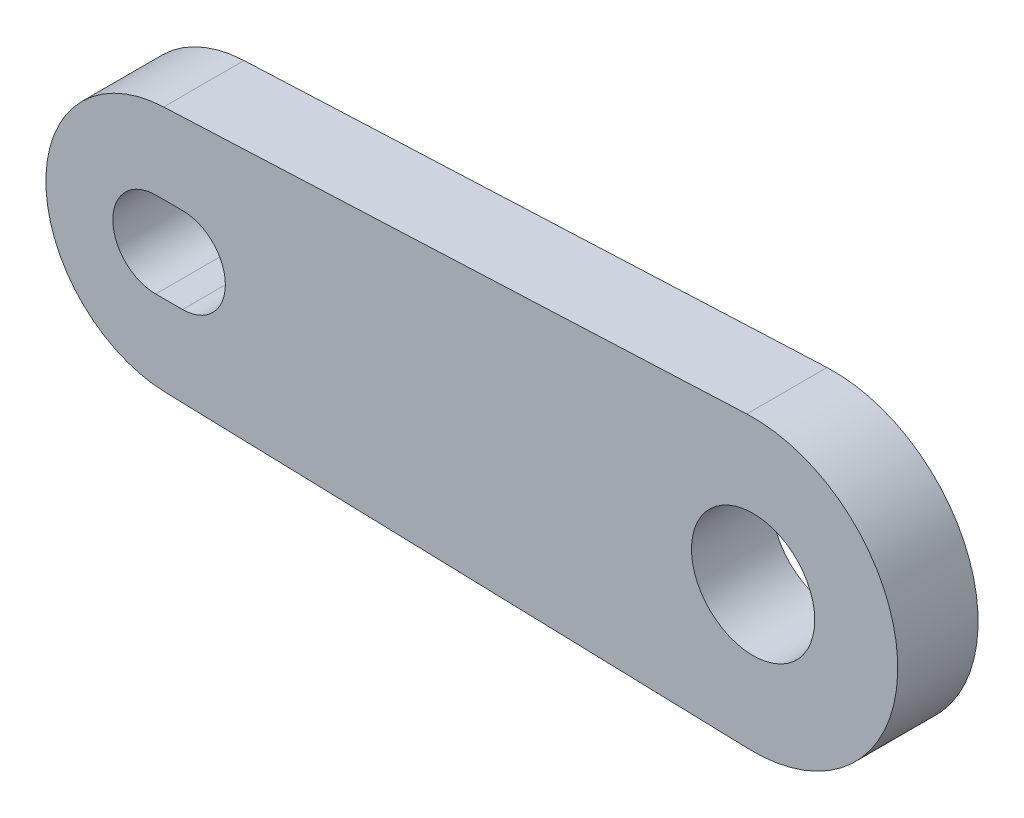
from build123d import *

# Parameters (mm, degrees)
SKETCH1_R           = 2.3
BOSS_EXTRUDE1_DEPTH = 3


with BuildPart() as part:
    # Sketch1 → Boss-Extrude1 (new body)
    with BuildSketch(Plane.XY.offset(-7.481745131)):
        with BuildLine():
            Line((-0.13778846, 0.153470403), (-21.902263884, -0.804448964))
            ThreePointArc((-21.902263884, -0.804448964), (-26.299878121, -5.433485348), (-21.835338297, -9.99800865))
            Line((-21.835338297, -9.99800865), (-0.059223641, -10.638969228))
            ThreePointArc((-0.059223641, -10.638969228), (5.499508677, -5.201998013), (-0.13778846, 0.153470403))
        make_face()
        with Locations((0.099651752, -5.241306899)):
            Circle(SKETCH1_R, mode=Mode.SUBTRACT)
        with BuildLine():
            Line((-21.2, -3.8), (-22.2, -3.8))
            ThreePointArc((-22.2, -3.8), (-23.8, -5.4), (-22.2, -7))
            Line((-22.2, -7), (-21.2, -7))
            ThreePointArc((-21.2, -7), (-19.6, -5.4), (-21.2, -3.8))
        make_face(mode=Mode.SUBTRACT)
    extrude(amount=BOSS_EXTRUDE1_DEPTH)


solid = part.part
